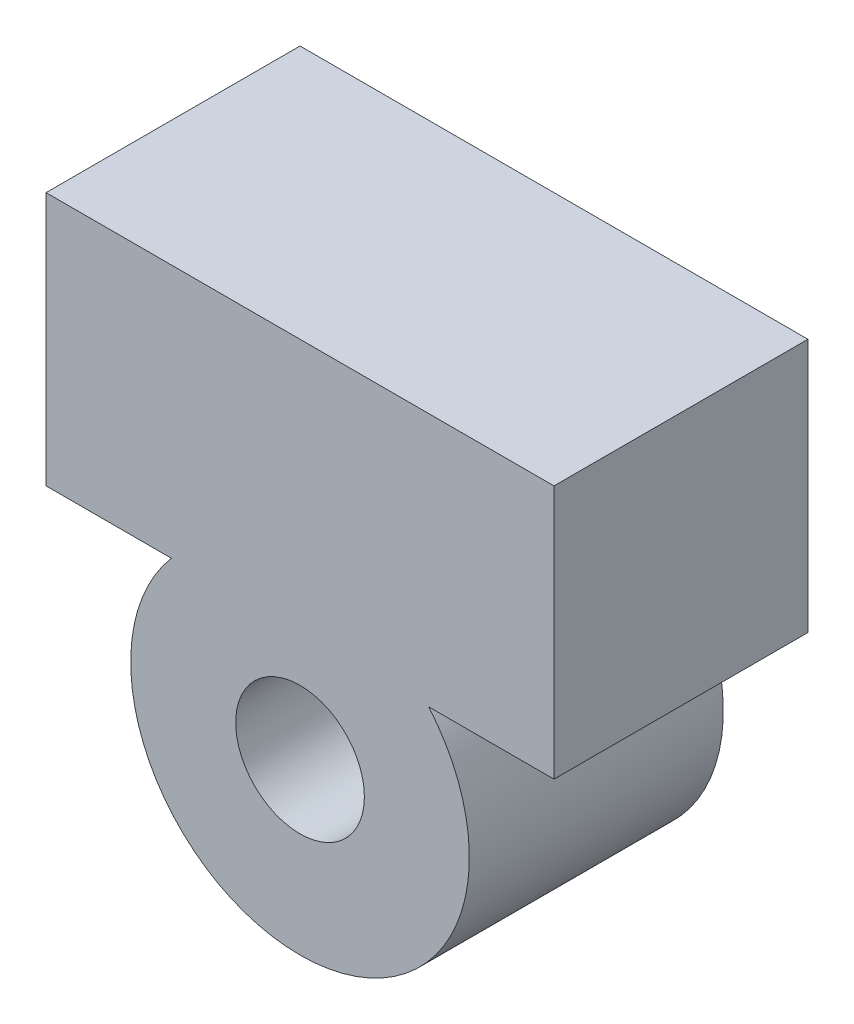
ISO-10303-21;
HEADER;
FILE_DESCRIPTION(('STEP AP214'),'2;1');
FILE_NAME('part.step','',(''),(''),'','','');
FILE_SCHEMA(('AUTOMOTIVE_DESIGN { 1 0 10303 214 1 1 1 1 }'));
ENDSEC;
DATA;
#1=APPLICATION_CONTEXT('core data for automotive mechanical design processes');
#2=APPLICATION_PROTOCOL_DEFINITION('international standard','automotive_design',2000,#1);
#3=PRODUCT_CONTEXT('',#1,'mechanical');
#4=PRODUCT('Part','Part','',(#3));
#5=PRODUCT_RELATED_PRODUCT_CATEGORY('part','',(#4));
#6=PRODUCT_DEFINITION_FORMATION('','',#4);
#7=PRODUCT_DEFINITION_CONTEXT('part definition',#1,'design');
#8=PRODUCT_DEFINITION('design','',#6,#7);
#9=PRODUCT_DEFINITION_SHAPE('','',#8);
#10=(LENGTH_UNIT() NAMED_UNIT(*) SI_UNIT(.MILLI.,.METRE.));
#11=(NAMED_UNIT(*) PLANE_ANGLE_UNIT() SI_UNIT($,.RADIAN.));
#12=(NAMED_UNIT(*) SI_UNIT($,.STERADIAN.) SOLID_ANGLE_UNIT());
#13=UNCERTAINTY_MEASURE_WITH_UNIT(LENGTH_MEASURE(1.E-05),#10,'distance_accuracy_value','');
#14=(GEOMETRIC_REPRESENTATION_CONTEXT(3) GLOBAL_UNCERTAINTY_ASSIGNED_CONTEXT((#13)) GLOBAL_UNIT_ASSIGNED_CONTEXT((#10,
#11,#12)) REPRESENTATION_CONTEXT('',''));
#15=CARTESIAN_POINT('',(0.,0.,0.));
#16=DIRECTION('',(0.,0.,1.));
#17=DIRECTION('',(1.,0.,0.));
#18=AXIS2_PLACEMENT_3D('',#15,#16,#17);
#19=CARTESIAN_POINT('',(0.,0.,30.));
#20=DIRECTION('',(0.,0.,-1.));
#21=DIRECTION('',(-1.,0.,0.));
#22=AXIS2_PLACEMENT_3D('',#19,#20,#21);
#23=CYLINDRICAL_SURFACE('',#22,20.);
#24=CARTESIAN_POINT('',(0.,0.,0.));
#25=DIRECTION('',(0.,0.,1.));
#26=DIRECTION('',(1.,0.,0.));
#27=AXIS2_PLACEMENT_3D('',#24,#25,#26);
#28=CIRCLE('',#27,20.);
#29=CARTESIAN_POINT('',(-15.1986841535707,13.,0.));
#30=VERTEX_POINT('',#29);
#31=CARTESIAN_POINT('',(15.1986841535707,13.,0.));
#32=VERTEX_POINT('',#31);
#33=EDGE_CURVE('E123',#30,#32,#28,.T.);
#34=ORIENTED_EDGE('',*,*,#33,.T.);
#35=DIRECTION('',(0.,0.,-1.));
#36=VECTOR('',#35,1.);
#37=CARTESIAN_POINT('',(15.1986841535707,13.,30.));
#38=LINE('',#37,#36);
#39=CARTESIAN_POINT('',(15.1986841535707,13.,30.));
#40=VERTEX_POINT('',#39);
#41=EDGE_CURVE('E11',#40,#32,#38,.T.);
#42=ORIENTED_EDGE('',*,*,#41,.F.);
#43=CARTESIAN_POINT('',(0.,0.,30.));
#44=DIRECTION('',(0.,0.,1.));
#45=DIRECTION('',(1.,0.,0.));
#46=AXIS2_PLACEMENT_3D('',#43,#44,#45);
#47=CIRCLE('',#46,20.);
#48=CARTESIAN_POINT('',(-15.1986841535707,13.,30.));
#49=VERTEX_POINT('',#48);
#50=EDGE_CURVE('E134',#49,#40,#47,.T.);
#51=ORIENTED_EDGE('',*,*,#50,.F.);
#52=DIRECTION('',(0.,0.,-1.));
#53=VECTOR('',#52,1.);
#54=CARTESIAN_POINT('',(-15.1986841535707,13.,30.));
#55=LINE('',#54,#53);
#56=EDGE_CURVE('E119',#49,#30,#55,.T.);
#57=ORIENTED_EDGE('',*,*,#56,.T.);
#58=EDGE_LOOP('',(#34,#42,#51,#57));
#59=FACE_BOUND('',#58,.T.);
#60=ADVANCED_FACE('F39',(#59),#23,.T.);
#61=CARTESIAN_POINT('',(29.9986841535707,13.,30.));
#62=DIRECTION('',(0.,1.,0.));
#63=DIRECTION('',(-1.,0.,0.));
#64=AXIS2_PLACEMENT_3D('',#61,#62,#63);
#65=PLANE('',#64);
#66=DIRECTION('',(1.,0.,0.));
#67=VECTOR('',#66,1.);
#68=CARTESIAN_POINT('',(29.9986841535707,13.,0.));
#69=LINE('',#68,#67);
#70=CARTESIAN_POINT('',(29.9986841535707,13.,0.));
#71=VERTEX_POINT('',#70);
#72=EDGE_CURVE('E126',#32,#71,#69,.T.);
#73=ORIENTED_EDGE('',*,*,#72,.T.);
#74=DIRECTION('',(0.,0.,-1.));
#75=VECTOR('',#74,1.);
#76=CARTESIAN_POINT('',(29.9986841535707,13.,30.));
#77=LINE('',#76,#75);
#78=CARTESIAN_POINT('',(29.9986841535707,13.,30.));
#79=VERTEX_POINT('',#78);
#80=EDGE_CURVE('E47',#79,#71,#77,.T.);
#81=ORIENTED_EDGE('',*,*,#80,.F.);
#82=DIRECTION('',(1.,0.,0.));
#83=VECTOR('',#82,1.);
#84=CARTESIAN_POINT('',(29.9986841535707,13.,30.));
#85=LINE('',#84,#83);
#86=EDGE_CURVE('E92',#40,#79,#85,.T.);
#87=ORIENTED_EDGE('',*,*,#86,.F.);
#88=ORIENTED_EDGE('',*,*,#41,.T.);
#89=EDGE_LOOP('',(#73,#81,#87,#88));
#90=FACE_BOUND('',#89,.T.);
#91=ADVANCED_FACE('F159',(#90),#65,.F.);
#92=CARTESIAN_POINT('',(29.9986841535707,43.,30.));
#93=DIRECTION('',(-1.,0.,0.));
#94=DIRECTION('',(0.,-1.,0.));
#95=AXIS2_PLACEMENT_3D('',#92,#93,#94);
#96=PLANE('',#95);
#97=DIRECTION('',(0.,1.,0.));
#98=VECTOR('',#97,1.);
#99=CARTESIAN_POINT('',(29.9986841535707,43.,0.));
#100=LINE('',#99,#98);
#101=CARTESIAN_POINT('',(29.9986841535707,43.,0.));
#102=VERTEX_POINT('',#101);
#103=EDGE_CURVE('E129',#71,#102,#100,.T.);
#104=ORIENTED_EDGE('',*,*,#103,.T.);
#105=DIRECTION('',(0.,0.,-1.));
#106=VECTOR('',#105,1.);
#107=CARTESIAN_POINT('',(29.9986841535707,43.,30.));
#108=LINE('',#107,#106);
#109=CARTESIAN_POINT('',(29.9986841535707,43.,30.));
#110=VERTEX_POINT('',#109);
#111=EDGE_CURVE('E114',#110,#102,#108,.T.);
#112=ORIENTED_EDGE('',*,*,#111,.F.);
#113=DIRECTION('',(0.,1.,0.));
#114=VECTOR('',#113,1.);
#115=CARTESIAN_POINT('',(29.9986841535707,43.,30.));
#116=LINE('',#115,#114);
#117=EDGE_CURVE('E105',#79,#110,#116,.T.);
#118=ORIENTED_EDGE('',*,*,#117,.F.);
#119=ORIENTED_EDGE('',*,*,#80,.T.);
#120=EDGE_LOOP('',(#104,#112,#118,#119));
#121=FACE_BOUND('',#120,.T.);
#122=ADVANCED_FACE('F140',(#121),#96,.F.);
#123=CARTESIAN_POINT('',(-30.0013158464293,43.,30.));
#124=DIRECTION('',(0.,-1.,0.));
#125=DIRECTION('',(0.,0.,-1.));
#126=AXIS2_PLACEMENT_3D('',#123,#124,#125);
#127=PLANE('',#126);
#128=DIRECTION('',(-1.,0.,0.));
#129=VECTOR('',#128,1.);
#130=CARTESIAN_POINT('',(-30.0013158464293,43.,0.));
#131=LINE('',#130,#129);
#132=CARTESIAN_POINT('',(-30.0013158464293,43.,0.));
#133=VERTEX_POINT('',#132);
#134=EDGE_CURVE('E113',#102,#133,#131,.T.);
#135=ORIENTED_EDGE('',*,*,#134,.T.);
#136=DIRECTION('',(0.,0.,-1.));
#137=VECTOR('',#136,1.);
#138=CARTESIAN_POINT('',(-30.0013158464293,43.,30.));
#139=LINE('',#138,#137);
#140=CARTESIAN_POINT('',(-30.0013158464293,43.,30.));
#141=VERTEX_POINT('',#140);
#142=EDGE_CURVE('E110',#141,#133,#139,.T.);
#143=ORIENTED_EDGE('',*,*,#142,.F.);
#144=DIRECTION('',(-1.,0.,0.));
#145=VECTOR('',#144,1.);
#146=CARTESIAN_POINT('',(-30.0013158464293,43.,30.));
#147=LINE('',#146,#145);
#148=EDGE_CURVE('E99',#110,#141,#147,.T.);
#149=ORIENTED_EDGE('',*,*,#148,.F.);
#150=ORIENTED_EDGE('',*,*,#111,.T.);
#151=EDGE_LOOP('',(#135,#143,#149,#150));
#152=FACE_BOUND('',#151,.T.);
#153=ADVANCED_FACE('F111',(#152),#127,.F.);
#154=CARTESIAN_POINT('',(-30.0013158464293,13.,30.));
#155=DIRECTION('',(1.,0.,0.));
#156=DIRECTION('',(0.,1.,0.));
#157=AXIS2_PLACEMENT_3D('',#154,#155,#156);
#158=PLANE('',#157);
#159=DIRECTION('',(0.,-1.,0.));
#160=VECTOR('',#159,1.);
#161=CARTESIAN_POINT('',(-30.0013158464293,13.,0.));
#162=LINE('',#161,#160);
#163=CARTESIAN_POINT('',(-30.0013158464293,13.,0.));
#164=VERTEX_POINT('',#163);
#165=EDGE_CURVE('E78',#133,#164,#162,.T.);
#166=ORIENTED_EDGE('',*,*,#165,.T.);
#167=DIRECTION('',(0.,0.,-1.));
#168=VECTOR('',#167,1.);
#169=CARTESIAN_POINT('',(-30.0013158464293,13.,30.));
#170=LINE('',#169,#168);
#171=CARTESIAN_POINT('',(-30.0013158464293,13.,30.));
#172=VERTEX_POINT('',#171);
#173=EDGE_CURVE('E115',#172,#164,#170,.T.);
#174=ORIENTED_EDGE('',*,*,#173,.F.);
#175=DIRECTION('',(0.,-1.,0.));
#176=VECTOR('',#175,1.);
#177=CARTESIAN_POINT('',(-30.0013158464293,13.,30.));
#178=LINE('',#177,#176);
#179=EDGE_CURVE('E103',#141,#172,#178,.T.);
#180=ORIENTED_EDGE('',*,*,#179,.F.);
#181=ORIENTED_EDGE('',*,*,#142,.T.);
#182=EDGE_LOOP('',(#166,#174,#180,#181));
#183=FACE_BOUND('',#182,.T.);
#184=ADVANCED_FACE('F117',(#183),#158,.F.);
#185=CARTESIAN_POINT('',(-15.1986841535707,13.,30.));
#186=DIRECTION('',(0.,1.,0.));
#187=DIRECTION('',(-1.,0.,0.));
#188=AXIS2_PLACEMENT_3D('',#185,#186,#187);
#189=PLANE('',#188);
#190=DIRECTION('',(1.,0.,0.));
#191=VECTOR('',#190,1.);
#192=CARTESIAN_POINT('',(-15.1986841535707,13.,0.));
#193=LINE('',#192,#191);
#194=EDGE_CURVE('E84',#164,#30,#193,.T.);
#195=ORIENTED_EDGE('',*,*,#194,.T.);
#196=ORIENTED_EDGE('',*,*,#56,.F.);
#197=DIRECTION('',(1.,0.,0.));
#198=VECTOR('',#197,1.);
#199=CARTESIAN_POINT('',(-15.1986841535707,13.,30.));
#200=LINE('',#199,#198);
#201=EDGE_CURVE('E55',#172,#49,#200,.T.);
#202=ORIENTED_EDGE('',*,*,#201,.F.);
#203=ORIENTED_EDGE('',*,*,#173,.T.);
#204=EDGE_LOOP('',(#195,#196,#202,#203));
#205=FACE_BOUND('',#204,.T.);
#206=ADVANCED_FACE('F147',(#205),#189,.F.);
#207=CARTESIAN_POINT('',(0.,0.,30.));
#208=DIRECTION('',(0.,0.,1.));
#209=DIRECTION('',(1.,0.,0.));
#210=AXIS2_PLACEMENT_3D('',#207,#208,#209);
#211=PLANE('',#210);
#212=CARTESIAN_POINT('',(0.,0.,30.));
#213=DIRECTION('',(0.,0.,1.));
#214=DIRECTION('',(1.,0.,0.));
#215=AXIS2_PLACEMENT_3D('',#212,#213,#214);
#216=CIRCLE('',#215,7.6);
#217=CARTESIAN_POINT('',(7.6,0.,30.));
#218=VERTEX_POINT('',#217);
#219=EDGE_CURVE('E215',#218,#218,#216,.T.);
#220=ORIENTED_EDGE('',*,*,#219,.F.);
#221=EDGE_LOOP('',(#220));
#222=FACE_BOUND('',#221,.T.);
#223=ORIENTED_EDGE('',*,*,#50,.T.);
#224=ORIENTED_EDGE('',*,*,#86,.T.);
#225=ORIENTED_EDGE('',*,*,#117,.T.);
#226=ORIENTED_EDGE('',*,*,#148,.T.);
#227=ORIENTED_EDGE('',*,*,#179,.T.);
#228=ORIENTED_EDGE('',*,*,#201,.T.);
#229=EDGE_LOOP('',(#223,#224,#225,#226,#227,#228));
#230=FACE_BOUND('',#229,.T.);
#231=ADVANCED_FACE('F101',(#222,#230),#211,.T.);
#232=CARTESIAN_POINT('',(0.,0.,0.));
#233=DIRECTION('',(0.,0.,1.));
#234=DIRECTION('',(1.,0.,0.));
#235=AXIS2_PLACEMENT_3D('',#232,#233,#234);
#236=PLANE('',#235);
#237=CARTESIAN_POINT('',(0.,0.,0.));
#238=DIRECTION('',(0.,0.,1.));
#239=DIRECTION('',(1.,0.,0.));
#240=AXIS2_PLACEMENT_3D('',#237,#238,#239);
#241=CIRCLE('',#240,7.6);
#242=CARTESIAN_POINT('',(7.6,0.,0.));
#243=VERTEX_POINT('',#242);
#244=EDGE_CURVE('E127',#243,#243,#241,.T.);
#245=ORIENTED_EDGE('',*,*,#244,.T.);
#246=EDGE_LOOP('',(#245));
#247=FACE_BOUND('',#246,.T.);
#248=ORIENTED_EDGE('',*,*,#33,.F.);
#249=ORIENTED_EDGE('',*,*,#194,.F.);
#250=ORIENTED_EDGE('',*,*,#165,.F.);
#251=ORIENTED_EDGE('',*,*,#134,.F.);
#252=ORIENTED_EDGE('',*,*,#103,.F.);
#253=ORIENTED_EDGE('',*,*,#72,.F.);
#254=EDGE_LOOP('',(#248,#249,#250,#251,#252,#253));
#255=FACE_BOUND('',#254,.T.);
#256=ADVANCED_FACE('F143',(#247,#255),#236,.F.);
#257=CARTESIAN_POINT('',(0.,0.,0.));
#258=DIRECTION('',(0.,0.,1.));
#259=DIRECTION('',(1.,0.,0.));
#260=AXIS2_PLACEMENT_3D('',#257,#258,#259);
#261=CYLINDRICAL_SURFACE('',#260,7.6);
#262=ORIENTED_EDGE('',*,*,#244,.F.);
#263=EDGE_LOOP('',(#262));
#264=FACE_BOUND('',#263,.T.);
#265=ORIENTED_EDGE('',*,*,#219,.T.);
#266=EDGE_LOOP('',(#265));
#267=FACE_BOUND('',#266,.T.);
#268=ADVANCED_FACE('F198',(#264,#267),#261,.F.);
#269=CLOSED_SHELL('',(#60,#91,#122,#153,#184,#206,#231,#256,#268));
#270=MANIFOLD_SOLID_BREP('B2',#269);
#271=ADVANCED_BREP_SHAPE_REPRESENTATION('',(#18,#270),#14);
#272=SHAPE_DEFINITION_REPRESENTATION(#9,#271);
ENDSEC;
END-ISO-10303-21;
